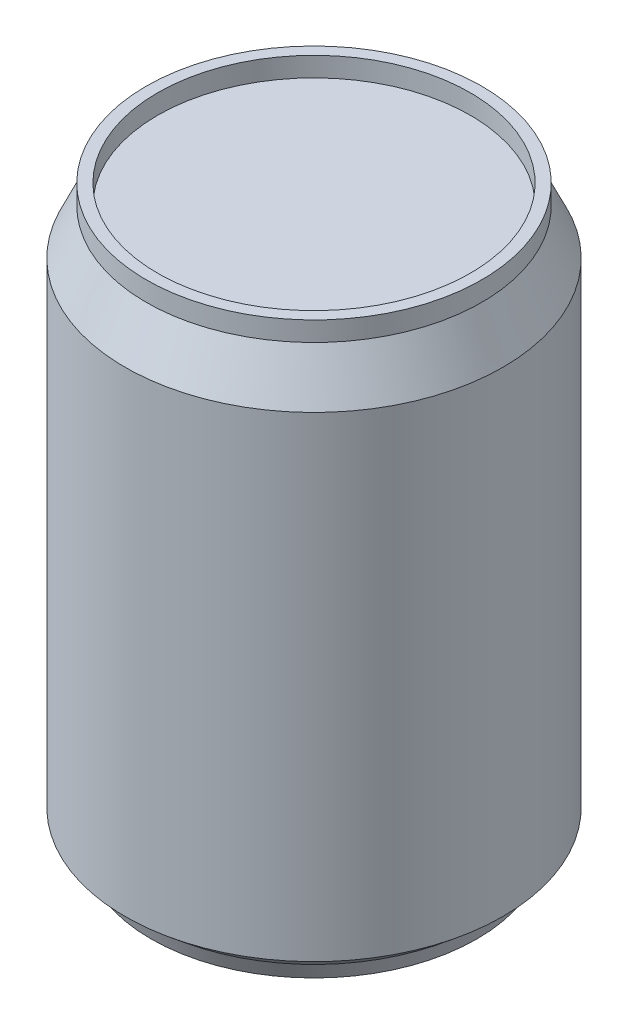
from build123d import *


with BuildPart() as part:
    # Esquisse1 → R_volution1 (revolve)
    with BuildSketch(Plane.XY):
        with BuildLine():
            Line((0, 85), (-24, 85))
            Line((-24, 85), (-24, 88))
            Line((-24, 88), (-25.75, 88))
            Line((-25.75, 88), (-25.75, 85))
            Line((-25.75, 85), (-29, 78))
            Line((-29, 78), (-29, 5))
            Line((-29, 5), (-26, 2.5))
            Line((-26, 2.5), (-25, 0))
            Line((-25, 0), (-22, 0))
            Line((-22, 0), (-22, 2.5))
            ThreePointArc((-22, 2.5), (-11.621639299, 8.073475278), (0, 10))
            Line((0, 10), (0, 85))
        make_face()
    revolve(axis=Axis((0, 85, 0), (0, -1, 0)))


solid = part.part
